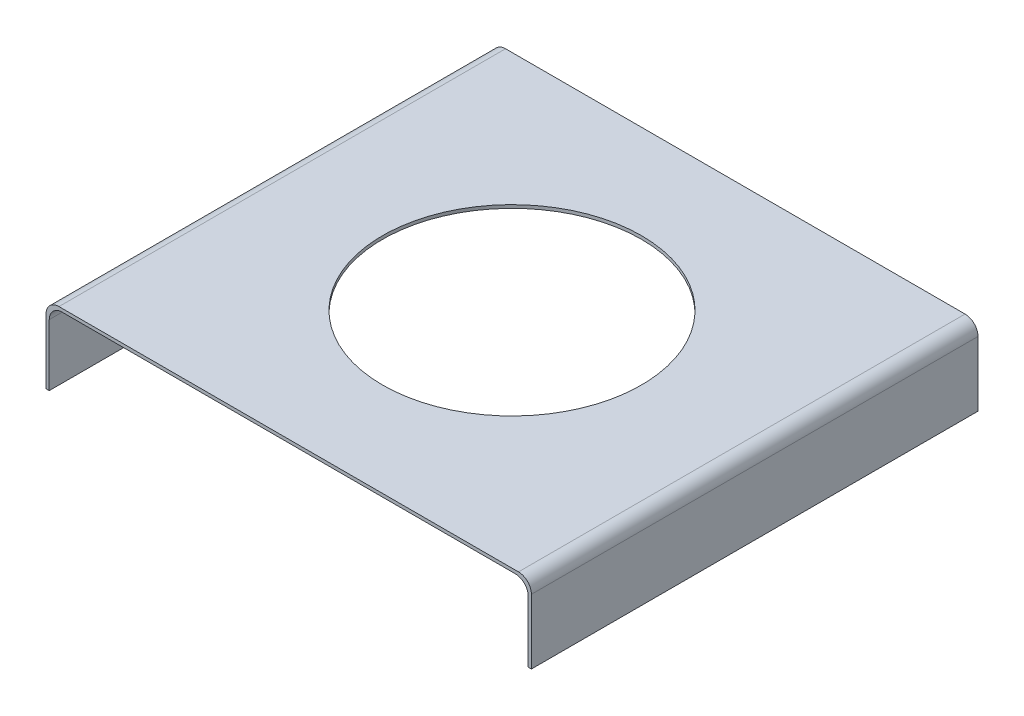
ISO-10303-21;
HEADER;
FILE_DESCRIPTION(('STEP AP214'),'2;1');
FILE_NAME('part.step','',(''),(''),'','','');
FILE_SCHEMA(('AUTOMOTIVE_DESIGN { 1 0 10303 214 1 1 1 1 }'));
ENDSEC;
DATA;
#1=APPLICATION_CONTEXT('core data for automotive mechanical design processes');
#2=APPLICATION_PROTOCOL_DEFINITION('international standard','automotive_design',2000,#1);
#3=PRODUCT_CONTEXT('',#1,'mechanical');
#4=PRODUCT('Part','Part','',(#3));
#5=PRODUCT_RELATED_PRODUCT_CATEGORY('part','',(#4));
#6=PRODUCT_DEFINITION_FORMATION('','',#4);
#7=PRODUCT_DEFINITION_CONTEXT('part definition',#1,'design');
#8=PRODUCT_DEFINITION('design','',#6,#7);
#9=PRODUCT_DEFINITION_SHAPE('','',#8);
#10=(LENGTH_UNIT() NAMED_UNIT(*) SI_UNIT(.MILLI.,.METRE.));
#11=(NAMED_UNIT(*) PLANE_ANGLE_UNIT() SI_UNIT($,.RADIAN.));
#12=(NAMED_UNIT(*) SI_UNIT($,.STERADIAN.) SOLID_ANGLE_UNIT());
#13=UNCERTAINTY_MEASURE_WITH_UNIT(LENGTH_MEASURE(1.E-05),#10,'distance_accuracy_value','');
#14=(GEOMETRIC_REPRESENTATION_CONTEXT(3) GLOBAL_UNCERTAINTY_ASSIGNED_CONTEXT((#13)) GLOBAL_UNIT_ASSIGNED_CONTEXT((#10,
#11,#12)) REPRESENTATION_CONTEXT('',''));
#15=CARTESIAN_POINT('',(0.,0.,0.));
#16=DIRECTION('',(0.,0.,1.));
#17=DIRECTION('',(1.,0.,0.));
#18=AXIS2_PLACEMENT_3D('',#15,#16,#17);
#19=CARTESIAN_POINT('',(-18.75,0.,17.25));
#20=DIRECTION('',(1.,0.,0.));
#21=DIRECTION('',(0.,0.,-1.));
#22=AXIS2_PLACEMENT_3D('',#19,#20,#21);
#23=PLANE('',#22);
#24=DIRECTION('',(0.,-1.,0.));
#25=VECTOR('',#24,1.);
#26=CARTESIAN_POINT('',(-18.75,0.,17.25));
#27=LINE('',#26,#25);
#28=CARTESIAN_POINT('',(-18.75,-1.,17.25));
#29=VERTEX_POINT('',#28);
#30=CARTESIAN_POINT('',(-18.75,-6.,17.25));
#31=VERTEX_POINT('',#30);
#32=EDGE_CURVE('E126',#29,#31,#27,.T.);
#33=ORIENTED_EDGE('',*,*,#32,.F.);
#34=DIRECTION('',(0.,0.,-1.));
#35=VECTOR('',#34,1.);
#36=CARTESIAN_POINT('',(-18.75,-1.,17.25));
#37=LINE('',#36,#35);
#38=CARTESIAN_POINT('',(-18.75,-1.,-17.25));
#39=VERTEX_POINT('',#38);
#40=EDGE_CURVE('E164',#29,#39,#37,.T.);
#41=ORIENTED_EDGE('',*,*,#40,.T.);
#42=DIRECTION('',(0.,-1.,0.));
#43=VECTOR('',#42,1.);
#44=CARTESIAN_POINT('',(-18.75,0.,-17.25));
#45=LINE('',#44,#43);
#46=CARTESIAN_POINT('',(-18.75,-6.,-17.25));
#47=VERTEX_POINT('',#46);
#48=EDGE_CURVE('E150',#39,#47,#45,.T.);
#49=ORIENTED_EDGE('',*,*,#48,.T.);
#50=DIRECTION('',(0.,0.,-1.));
#51=VECTOR('',#50,1.);
#52=CARTESIAN_POINT('',(-18.75,-6.,17.25));
#53=LINE('',#52,#51);
#54=EDGE_CURVE('E143',#31,#47,#53,.T.);
#55=ORIENTED_EDGE('',*,*,#54,.F.);
#56=EDGE_LOOP('',(#33,#41,#49,#55));
#57=FACE_BOUND('',#56,.T.);
#58=ADVANCED_FACE('F37',(#57),#23,.F.);
#59=CARTESIAN_POINT('',(-18.75,-6.,17.25));
#60=DIRECTION('',(0.,1.,0.));
#61=DIRECTION('',(0.,0.,1.));
#62=AXIS2_PLACEMENT_3D('',#59,#60,#61);
#63=PLANE('',#62);
#64=DIRECTION('',(1.,0.,0.));
#65=VECTOR('',#64,1.);
#66=CARTESIAN_POINT('',(-18.75,-6.,-17.25));
#67=LINE('',#66,#65);
#68=CARTESIAN_POINT('',(-18.5,-6.,-17.25));
#69=VERTEX_POINT('',#68);
#70=EDGE_CURVE('E224',#47,#69,#67,.T.);
#71=ORIENTED_EDGE('',*,*,#70,.T.);
#72=DIRECTION('',(0.,0.,-1.));
#73=VECTOR('',#72,1.);
#74=CARTESIAN_POINT('',(-18.5,-6.,17.25));
#75=LINE('',#74,#73);
#76=CARTESIAN_POINT('',(-18.5,-6.,17.25));
#77=VERTEX_POINT('',#76);
#78=EDGE_CURVE('E145',#77,#69,#75,.T.);
#79=ORIENTED_EDGE('',*,*,#78,.F.);
#80=DIRECTION('',(1.,0.,0.));
#81=VECTOR('',#80,1.);
#82=CARTESIAN_POINT('',(-18.75,-6.,17.25));
#83=LINE('',#82,#81);
#84=EDGE_CURVE('E131',#31,#77,#83,.T.);
#85=ORIENTED_EDGE('',*,*,#84,.F.);
#86=ORIENTED_EDGE('',*,*,#54,.T.);
#87=EDGE_LOOP('',(#71,#79,#85,#86));
#88=FACE_BOUND('',#87,.T.);
#89=ADVANCED_FACE('F142',(#88),#63,.F.);
#90=CARTESIAN_POINT('',(-18.5,-0.25,17.25));
#91=DIRECTION('',(-1.,0.,0.));
#92=DIRECTION('',(0.,0.,1.));
#93=AXIS2_PLACEMENT_3D('',#90,#91,#92);
#94=PLANE('',#93);
#95=DIRECTION('',(0.,1.,0.));
#96=VECTOR('',#95,1.);
#97=CARTESIAN_POINT('',(-18.5,-0.25,-17.25));
#98=LINE('',#97,#96);
#99=CARTESIAN_POINT('',(-18.5,-1.25,-17.25));
#100=VERTEX_POINT('',#99);
#101=EDGE_CURVE('E227',#69,#100,#98,.T.);
#102=ORIENTED_EDGE('',*,*,#101,.T.);
#103=DIRECTION('',(0.,0.,-1.));
#104=VECTOR('',#103,1.);
#105=CARTESIAN_POINT('',(-18.5,-1.25,17.25));
#106=LINE('',#105,#104);
#107=CARTESIAN_POINT('',(-18.5,-1.25,17.25));
#108=VERTEX_POINT('',#107);
#109=EDGE_CURVE('E162',#100,#108,#106,.F.);
#110=ORIENTED_EDGE('',*,*,#109,.T.);
#111=DIRECTION('',(0.,1.,0.));
#112=VECTOR('',#111,1.);
#113=CARTESIAN_POINT('',(-18.5,-0.25,17.25));
#114=LINE('',#113,#112);
#115=EDGE_CURVE('E147',#77,#108,#114,.T.);
#116=ORIENTED_EDGE('',*,*,#115,.F.);
#117=ORIENTED_EDGE('',*,*,#78,.T.);
#118=EDGE_LOOP('',(#102,#110,#116,#117));
#119=FACE_BOUND('',#118,.T.);
#120=ADVANCED_FACE('F209',(#119),#94,.F.);
#121=CARTESIAN_POINT('',(-18.5,-0.25,17.25));
#122=DIRECTION('',(0.,1.,0.));
#123=DIRECTION('',(0.,0.,1.));
#124=AXIS2_PLACEMENT_3D('',#121,#122,#123);
#125=PLANE('',#124);
#126=CARTESIAN_POINT('',(0.,-0.25,0.));
#127=DIRECTION('',(0.,1.,0.));
#128=DIRECTION('',(0.,0.,1.));
#129=AXIS2_PLACEMENT_3D('',#126,#127,#128);
#130=CIRCLE('',#129,10.);
#131=CARTESIAN_POINT('',(0.,-0.25,10.));
#132=VERTEX_POINT('',#131);
#133=EDGE_CURVE('E225',#132,#132,#130,.T.);
#134=ORIENTED_EDGE('',*,*,#133,.T.);
#135=EDGE_LOOP('',(#134));
#136=FACE_BOUND('',#135,.T.);
#137=DIRECTION('',(1.,0.,0.));
#138=VECTOR('',#137,1.);
#139=CARTESIAN_POINT('',(-18.5,-0.25,17.25));
#140=LINE('',#139,#138);
#141=CARTESIAN_POINT('',(-17.5,-0.25,17.25));
#142=VERTEX_POINT('',#141);
#143=CARTESIAN_POINT('',(17.5,-0.25,17.25));
#144=VERTEX_POINT('',#143);
#145=EDGE_CURVE('E263',#142,#144,#140,.T.);
#146=ORIENTED_EDGE('',*,*,#145,.F.);
#147=DIRECTION('',(0.,0.,-1.));
#148=VECTOR('',#147,1.);
#149=CARTESIAN_POINT('',(-17.5,-0.25,-17.25));
#150=LINE('',#149,#148);
#151=CARTESIAN_POINT('',(-17.5,-0.25,-17.25));
#152=VERTEX_POINT('',#151);
#153=EDGE_CURVE('E154',#142,#152,#150,.T.);
#154=ORIENTED_EDGE('',*,*,#153,.T.);
#155=DIRECTION('',(1.,0.,0.));
#156=VECTOR('',#155,1.);
#157=CARTESIAN_POINT('',(-18.5,-0.25,-17.25));
#158=LINE('',#157,#156);
#159=CARTESIAN_POINT('',(17.5,-0.25,-17.25));
#160=VERTEX_POINT('',#159);
#161=EDGE_CURVE('E236',#152,#160,#158,.T.);
#162=ORIENTED_EDGE('',*,*,#161,.T.);
#163=DIRECTION('',(0.,0.,-1.));
#164=VECTOR('',#163,1.);
#165=CARTESIAN_POINT('',(17.5,-0.25,17.25));
#166=LINE('',#165,#164);
#167=EDGE_CURVE('E152',#160,#144,#166,.F.);
#168=ORIENTED_EDGE('',*,*,#167,.T.);
#169=EDGE_LOOP('',(#146,#154,#162,#168));
#170=FACE_BOUND('',#169,.T.);
#171=ADVANCED_FACE('F287',(#136,#170),#125,.F.);
#172=CARTESIAN_POINT('',(18.5,-0.25,17.25));
#173=DIRECTION('',(1.,0.,0.));
#174=DIRECTION('',(0.,0.,-1.));
#175=AXIS2_PLACEMENT_3D('',#172,#173,#174);
#176=PLANE('',#175);
#177=DIRECTION('',(0.,-1.,0.));
#178=VECTOR('',#177,1.);
#179=CARTESIAN_POINT('',(18.5,-0.25,17.25));
#180=LINE('',#179,#178);
#181=CARTESIAN_POINT('',(18.5,-1.25,17.25));
#182=VERTEX_POINT('',#181);
#183=CARTESIAN_POINT('',(18.5,-6.,17.25));
#184=VERTEX_POINT('',#183);
#185=EDGE_CURVE('E259',#182,#184,#180,.T.);
#186=ORIENTED_EDGE('',*,*,#185,.F.);
#187=DIRECTION('',(0.,0.,-1.));
#188=VECTOR('',#187,1.);
#189=CARTESIAN_POINT('',(18.5,-1.25,-17.25));
#190=LINE('',#189,#188);
#191=CARTESIAN_POINT('',(18.5,-1.25,-17.25));
#192=VERTEX_POINT('',#191);
#193=EDGE_CURVE('E171',#182,#192,#190,.T.);
#194=ORIENTED_EDGE('',*,*,#193,.T.);
#195=DIRECTION('',(0.,-1.,0.));
#196=VECTOR('',#195,1.);
#197=CARTESIAN_POINT('',(18.5,-0.25,-17.25));
#198=LINE('',#197,#196);
#199=CARTESIAN_POINT('',(18.5,-6.,-17.25));
#200=VERTEX_POINT('',#199);
#201=EDGE_CURVE('E239',#192,#200,#198,.T.);
#202=ORIENTED_EDGE('',*,*,#201,.T.);
#203=DIRECTION('',(0.,0.,-1.));
#204=VECTOR('',#203,1.);
#205=CARTESIAN_POINT('',(18.5,-6.,17.25));
#206=LINE('',#205,#204);
#207=EDGE_CURVE('E156',#184,#200,#206,.T.);
#208=ORIENTED_EDGE('',*,*,#207,.F.);
#209=EDGE_LOOP('',(#186,#194,#202,#208));
#210=FACE_BOUND('',#209,.T.);
#211=ADVANCED_FACE('F284',(#210),#176,.F.);
#212=CARTESIAN_POINT('',(18.5,-6.,17.25));
#213=DIRECTION('',(0.,1.,0.));
#214=DIRECTION('',(0.,0.,1.));
#215=AXIS2_PLACEMENT_3D('',#212,#213,#214);
#216=PLANE('',#215);
#217=DIRECTION('',(1.,0.,0.));
#218=VECTOR('',#217,1.);
#219=CARTESIAN_POINT('',(18.5,-6.,-17.25));
#220=LINE('',#219,#218);
#221=CARTESIAN_POINT('',(18.75,-6.,-17.25));
#222=VERTEX_POINT('',#221);
#223=EDGE_CURVE('E241',#200,#222,#220,.T.);
#224=ORIENTED_EDGE('',*,*,#223,.T.);
#225=DIRECTION('',(0.,0.,-1.));
#226=VECTOR('',#225,1.);
#227=CARTESIAN_POINT('',(18.75,-6.,17.25));
#228=LINE('',#227,#226);
#229=CARTESIAN_POINT('',(18.75,-6.,17.25));
#230=VERTEX_POINT('',#229);
#231=EDGE_CURVE('E195',#230,#222,#228,.T.);
#232=ORIENTED_EDGE('',*,*,#231,.F.);
#233=DIRECTION('',(1.,0.,0.));
#234=VECTOR('',#233,1.);
#235=CARTESIAN_POINT('',(18.5,-6.,17.25));
#236=LINE('',#235,#234);
#237=EDGE_CURVE('E254',#184,#230,#236,.T.);
#238=ORIENTED_EDGE('',*,*,#237,.F.);
#239=ORIENTED_EDGE('',*,*,#207,.T.);
#240=EDGE_LOOP('',(#224,#232,#238,#239));
#241=FACE_BOUND('',#240,.T.);
#242=ADVANCED_FACE('F252',(#241),#216,.F.);
#243=CARTESIAN_POINT('',(18.75,0.,17.25));
#244=DIRECTION('',(-1.,0.,0.));
#245=DIRECTION('',(0.,0.,1.));
#246=AXIS2_PLACEMENT_3D('',#243,#244,#245);
#247=PLANE('',#246);
#248=DIRECTION('',(0.,1.,0.));
#249=VECTOR('',#248,1.);
#250=CARTESIAN_POINT('',(18.75,0.,-17.25));
#251=LINE('',#250,#249);
#252=CARTESIAN_POINT('',(18.75,-1.,-17.25));
#253=VERTEX_POINT('',#252);
#254=EDGE_CURVE('E243',#222,#253,#251,.T.);
#255=ORIENTED_EDGE('',*,*,#254,.T.);
#256=DIRECTION('',(0.,0.,-1.));
#257=VECTOR('',#256,1.);
#258=CARTESIAN_POINT('',(18.75,-1.,17.25));
#259=LINE('',#258,#257);
#260=CARTESIAN_POINT('',(18.75,-1.,17.25));
#261=VERTEX_POINT('',#260);
#262=EDGE_CURVE('E52',#253,#261,#259,.F.);
#263=ORIENTED_EDGE('',*,*,#262,.T.);
#264=DIRECTION('',(0.,1.,0.));
#265=VECTOR('',#264,1.);
#266=CARTESIAN_POINT('',(18.75,0.,17.25));
#267=LINE('',#266,#265);
#268=EDGE_CURVE('E188',#230,#261,#267,.T.);
#269=ORIENTED_EDGE('',*,*,#268,.F.);
#270=ORIENTED_EDGE('',*,*,#231,.T.);
#271=EDGE_LOOP('',(#255,#263,#269,#270));
#272=FACE_BOUND('',#271,.T.);
#273=ADVANCED_FACE('F258',(#272),#247,.F.);
#274=CARTESIAN_POINT('',(-18.75,0.,17.25));
#275=DIRECTION('',(0.,-1.,0.));
#276=DIRECTION('',(0.,0.,-1.));
#277=AXIS2_PLACEMENT_3D('',#274,#275,#276);
#278=PLANE('',#277);
#279=CARTESIAN_POINT('',(0.,0.,0.));
#280=DIRECTION('',(0.,1.,0.));
#281=DIRECTION('',(0.,0.,1.));
#282=AXIS2_PLACEMENT_3D('',#279,#280,#281);
#283=CIRCLE('',#282,10.);
#284=CARTESIAN_POINT('',(0.,0.,10.));
#285=VERTEX_POINT('',#284);
#286=EDGE_CURVE('E230',#285,#285,#283,.T.);
#287=ORIENTED_EDGE('',*,*,#286,.F.);
#288=EDGE_LOOP('',(#287));
#289=FACE_BOUND('',#288,.T.);
#290=DIRECTION('',(-1.,0.,0.));
#291=VECTOR('',#290,1.);
#292=CARTESIAN_POINT('',(-18.75,0.,-17.25));
#293=LINE('',#292,#291);
#294=CARTESIAN_POINT('',(17.75,0.,-17.25));
#295=VERTEX_POINT('',#294);
#296=CARTESIAN_POINT('',(-17.75,0.,-17.25));
#297=VERTEX_POINT('',#296);
#298=EDGE_CURVE('E138',#295,#297,#293,.T.);
#299=ORIENTED_EDGE('',*,*,#298,.T.);
#300=DIRECTION('',(0.,0.,-1.));
#301=VECTOR('',#300,1.);
#302=CARTESIAN_POINT('',(-17.75,0.,17.25));
#303=LINE('',#302,#301);
#304=CARTESIAN_POINT('',(-17.75,0.,17.25));
#305=VERTEX_POINT('',#304);
#306=EDGE_CURVE('E169',#297,#305,#303,.F.);
#307=ORIENTED_EDGE('',*,*,#306,.T.);
#308=DIRECTION('',(-1.,0.,0.));
#309=VECTOR('',#308,1.);
#310=CARTESIAN_POINT('',(-18.75,0.,17.25));
#311=LINE('',#310,#309);
#312=CARTESIAN_POINT('',(17.75,0.,17.25));
#313=VERTEX_POINT('',#312);
#314=EDGE_CURVE('E187',#313,#305,#311,.T.);
#315=ORIENTED_EDGE('',*,*,#314,.F.);
#316=DIRECTION('',(0.,0.,-1.));
#317=VECTOR('',#316,1.);
#318=CARTESIAN_POINT('',(17.75,0.,17.25));
#319=LINE('',#318,#317);
#320=EDGE_CURVE('E166',#313,#295,#319,.T.);
#321=ORIENTED_EDGE('',*,*,#320,.T.);
#322=EDGE_LOOP('',(#299,#307,#315,#321));
#323=FACE_BOUND('',#322,.T.);
#324=ADVANCED_FACE('F193',(#289,#323),#278,.F.);
#325=CARTESIAN_POINT('',(0.,0.,17.25));
#326=DIRECTION('',(0.,0.,1.));
#327=DIRECTION('',(1.,0.,0.));
#328=AXIS2_PLACEMENT_3D('',#325,#326,#327);
#329=PLANE('',#328);
#330=ORIENTED_EDGE('',*,*,#314,.T.);
#331=CARTESIAN_POINT('',(-17.75,-1.,17.25));
#332=DIRECTION('',(0.,0.,1.));
#333=DIRECTION('',(1.,0.,0.));
#334=AXIS2_PLACEMENT_3D('',#331,#332,#333);
#335=CIRCLE('',#334,1.);
#336=EDGE_CURVE('E11',#305,#29,#335,.T.);
#337=ORIENTED_EDGE('',*,*,#336,.T.);
#338=ORIENTED_EDGE('',*,*,#32,.T.);
#339=ORIENTED_EDGE('',*,*,#84,.T.);
#340=ORIENTED_EDGE('',*,*,#115,.T.);
#341=CARTESIAN_POINT('',(-17.5,-1.25,17.25));
#342=DIRECTION('',(0.,0.,1.));
#343=DIRECTION('',(1.,0.,0.));
#344=AXIS2_PLACEMENT_3D('',#341,#342,#343);
#345=CIRCLE('',#344,1.);
#346=EDGE_CURVE('E177',#108,#142,#345,.F.);
#347=ORIENTED_EDGE('',*,*,#346,.T.);
#348=ORIENTED_EDGE('',*,*,#145,.T.);
#349=CARTESIAN_POINT('',(17.5,-1.25,17.25));
#350=DIRECTION('',(0.,0.,1.));
#351=DIRECTION('',(1.,0.,0.));
#352=AXIS2_PLACEMENT_3D('',#349,#350,#351);
#353=CIRCLE('',#352,1.);
#354=EDGE_CURVE('E181',#144,#182,#353,.F.);
#355=ORIENTED_EDGE('',*,*,#354,.T.);
#356=ORIENTED_EDGE('',*,*,#185,.T.);
#357=ORIENTED_EDGE('',*,*,#237,.T.);
#358=ORIENTED_EDGE('',*,*,#268,.T.);
#359=CARTESIAN_POINT('',(17.75,-1.,17.25));
#360=DIRECTION('',(0.,0.,1.));
#361=DIRECTION('',(1.,0.,0.));
#362=AXIS2_PLACEMENT_3D('',#359,#360,#361);
#363=CIRCLE('',#362,1.);
#364=EDGE_CURVE('E45',#261,#313,#363,.T.);
#365=ORIENTED_EDGE('',*,*,#364,.T.);
#366=EDGE_LOOP('',(#330,#337,#338,#339,#340,#347,#348,#355,#356,#357,#358,#365));
#367=FACE_BOUND('',#366,.T.);
#368=ADVANCED_FACE('F129',(#367),#329,.T.);
#369=CARTESIAN_POINT('',(0.,0.,-17.25));
#370=DIRECTION('',(0.,0.,1.));
#371=DIRECTION('',(1.,0.,0.));
#372=AXIS2_PLACEMENT_3D('',#369,#370,#371);
#373=PLANE('',#372);
#374=ORIENTED_EDGE('',*,*,#48,.F.);
#375=CARTESIAN_POINT('',(-17.75,-1.,-17.25));
#376=DIRECTION('',(0.,0.,1.));
#377=DIRECTION('',(1.,0.,0.));
#378=AXIS2_PLACEMENT_3D('',#375,#376,#377);
#379=CIRCLE('',#378,1.);
#380=EDGE_CURVE('E184',#39,#297,#379,.F.);
#381=ORIENTED_EDGE('',*,*,#380,.T.);
#382=ORIENTED_EDGE('',*,*,#298,.F.);
#383=CARTESIAN_POINT('',(17.75,-1.,-17.25));
#384=DIRECTION('',(0.,0.,1.));
#385=DIRECTION('',(1.,0.,0.));
#386=AXIS2_PLACEMENT_3D('',#383,#384,#385);
#387=CIRCLE('',#386,1.);
#388=EDGE_CURVE('E60',#295,#253,#387,.F.);
#389=ORIENTED_EDGE('',*,*,#388,.T.);
#390=ORIENTED_EDGE('',*,*,#254,.F.);
#391=ORIENTED_EDGE('',*,*,#223,.F.);
#392=ORIENTED_EDGE('',*,*,#201,.F.);
#393=CARTESIAN_POINT('',(17.5,-1.25,-17.25));
#394=DIRECTION('',(0.,0.,1.));
#395=DIRECTION('',(1.,0.,0.));
#396=AXIS2_PLACEMENT_3D('',#393,#394,#395);
#397=CIRCLE('',#396,1.);
#398=EDGE_CURVE('E179',#192,#160,#397,.T.);
#399=ORIENTED_EDGE('',*,*,#398,.T.);
#400=ORIENTED_EDGE('',*,*,#161,.F.);
#401=CARTESIAN_POINT('',(-17.5,-1.25,-17.25));
#402=DIRECTION('',(0.,0.,1.));
#403=DIRECTION('',(1.,0.,0.));
#404=AXIS2_PLACEMENT_3D('',#401,#402,#403);
#405=CIRCLE('',#404,1.);
#406=EDGE_CURVE('E175',#152,#100,#405,.T.);
#407=ORIENTED_EDGE('',*,*,#406,.T.);
#408=ORIENTED_EDGE('',*,*,#101,.F.);
#409=ORIENTED_EDGE('',*,*,#70,.F.);
#410=EDGE_LOOP('',(#374,#381,#382,#389,#390,#391,#392,#399,#400,#407,#408,#409));
#411=FACE_BOUND('',#410,.T.);
#412=ADVANCED_FACE('F222',(#411),#373,.F.);
#413=CARTESIAN_POINT('',(0.,-6.,0.));
#414=DIRECTION('',(0.,1.,0.));
#415=DIRECTION('',(0.,0.,1.));
#416=AXIS2_PLACEMENT_3D('',#413,#414,#415);
#417=CYLINDRICAL_SURFACE('',#416,10.);
#418=ORIENTED_EDGE('',*,*,#286,.T.);
#419=EDGE_LOOP('',(#418));
#420=FACE_BOUND('',#419,.T.);
#421=ORIENTED_EDGE('',*,*,#133,.F.);
#422=EDGE_LOOP('',(#421));
#423=FACE_BOUND('',#422,.T.);
#424=ADVANCED_FACE('F216',(#420,#423),#417,.F.);
#425=CARTESIAN_POINT('',(-17.5,-1.25,17.25));
#426=DIRECTION('',(0.,0.,1.));
#427=DIRECTION('',(1.,0.,0.));
#428=AXIS2_PLACEMENT_3D('',#425,#426,#427);
#429=CYLINDRICAL_SURFACE('',#428,1.);
#430=ORIENTED_EDGE('',*,*,#346,.F.);
#431=ORIENTED_EDGE('',*,*,#109,.F.);
#432=ORIENTED_EDGE('',*,*,#406,.F.);
#433=ORIENTED_EDGE('',*,*,#153,.F.);
#434=EDGE_LOOP('',(#430,#431,#432,#433));
#435=FACE_BOUND('',#434,.T.);
#436=ADVANCED_FACE('F213',(#435),#429,.F.);
#437=CARTESIAN_POINT('',(-17.75,-1.,17.25));
#438=DIRECTION('',(0.,0.,-1.));
#439=DIRECTION('',(-1.,0.,0.));
#440=AXIS2_PLACEMENT_3D('',#437,#438,#439);
#441=CYLINDRICAL_SURFACE('',#440,1.);
#442=ORIENTED_EDGE('',*,*,#336,.F.);
#443=ORIENTED_EDGE('',*,*,#306,.F.);
#444=ORIENTED_EDGE('',*,*,#380,.F.);
#445=ORIENTED_EDGE('',*,*,#40,.F.);
#446=EDGE_LOOP('',(#442,#443,#444,#445));
#447=FACE_BOUND('',#446,.T.);
#448=ADVANCED_FACE('F202',(#447),#441,.T.);
#449=CARTESIAN_POINT('',(17.5,-1.25,17.25));
#450=DIRECTION('',(0.,0.,1.));
#451=DIRECTION('',(1.,0.,0.));
#452=AXIS2_PLACEMENT_3D('',#449,#450,#451);
#453=CYLINDRICAL_SURFACE('',#452,1.);
#454=ORIENTED_EDGE('',*,*,#354,.F.);
#455=ORIENTED_EDGE('',*,*,#167,.F.);
#456=ORIENTED_EDGE('',*,*,#398,.F.);
#457=ORIENTED_EDGE('',*,*,#193,.F.);
#458=EDGE_LOOP('',(#454,#455,#456,#457));
#459=FACE_BOUND('',#458,.T.);
#460=ADVANCED_FACE('F198',(#459),#453,.F.);
#461=CARTESIAN_POINT('',(17.75,-1.,17.25));
#462=DIRECTION('',(0.,0.,-1.));
#463=DIRECTION('',(-1.,0.,0.));
#464=AXIS2_PLACEMENT_3D('',#461,#462,#463);
#465=CYLINDRICAL_SURFACE('',#464,1.);
#466=ORIENTED_EDGE('',*,*,#364,.F.);
#467=ORIENTED_EDGE('',*,*,#262,.F.);
#468=ORIENTED_EDGE('',*,*,#388,.F.);
#469=ORIENTED_EDGE('',*,*,#320,.F.);
#470=EDGE_LOOP('',(#466,#467,#468,#469));
#471=FACE_BOUND('',#470,.T.);
#472=ADVANCED_FACE('F39',(#471),#465,.T.);
#473=CLOSED_SHELL('',(#58,#89,#120,#171,#211,#242,#273,#324,#368,#412,#424,#436,#448,#460,#472));
#474=MANIFOLD_SOLID_BREP('B2',#473);
#475=ADVANCED_BREP_SHAPE_REPRESENTATION('',(#18,#474),#14);
#476=SHAPE_DEFINITION_REPRESENTATION(#9,#475);
ENDSEC;
END-ISO-10303-21;
